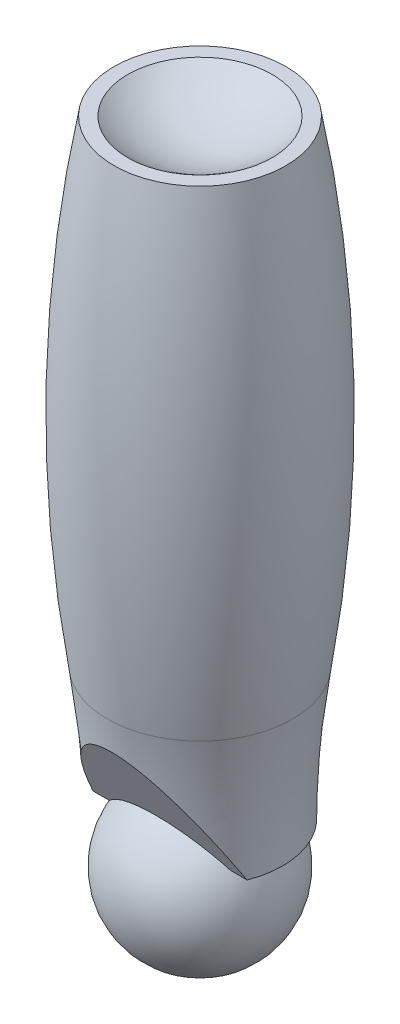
from build123d import *


with BuildPart() as part:
    # Skica1 → Oto_it kolem osy1 (revolve)
    with BuildSketch(Plane.XY, mode=Mode.PRIVATE) as oto_it_kolem_osy1_sk:
        with BuildLine():
            Line((0, 0), (0, 264.5))
            Line((0, 264.5), (37.375, 264.5))
            ThreePointArc((37.375, 264.5), (47.375366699, 161.119967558), (40.28024406, 57.5))
            ThreePointArc((40.28024406, 57.5), (37.02472985, 28.831880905), (35.9375, 0))
            Line((35.9375, 0), (0, 0))
        make_face()
    revolve(oto_it_kolem_osy1_sk.sketch.rotate(Axis((0, 0, 0), (0, 1, 0)), 90), axis=Axis((0, 0, 0), (0, 1, 0)))

    # Skica2 → Odebrat oto_en_m1 (revolve, cut)
    with BuildSketch(Plane.XY, mode=Mode.PRIVATE) as odebrat_oto_en_m1_sk:
        with BuildLine():
            Line((0, 253.5), (0, 303.815))
            Line((0, 303.815), (-50.315, 303.815))
            ThreePointArc((-50.315, 303.815), (-35.578077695, 268.236922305), (0, 253.5))
        make_face()
    revolve(odebrat_oto_en_m1_sk.sketch.rotate(Axis((0, 253.5, 0), (0, 1, 0)), 270), axis=Axis((0, 253.5, 0), (0, 1, 0)), mode=Mode.SUBTRACT)

    # Odebrat povrchem2
    split(bisect_by=Plane(origin=(0, -5.629165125, 9.75), x_dir=(-1, 0, 0), z_dir=(0, 0.5000000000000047, -0.866025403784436)), keep=Keep.TOP)

    # Skica3 → Oto_it kolem osy2 (revolve)
    with BuildSketch(Plane.XY):
        with BuildLine():
            Line((0, -18), (0, 16.5))
            ThreePointArc((0, 16.5), (-34.5, -18), (0, -52.5))
            Line((0, -52.5), (0, -18))
        make_face()
    revolve(axis=Axis((0, -18, 0), (0, 1, 0)))


solid = part.part
